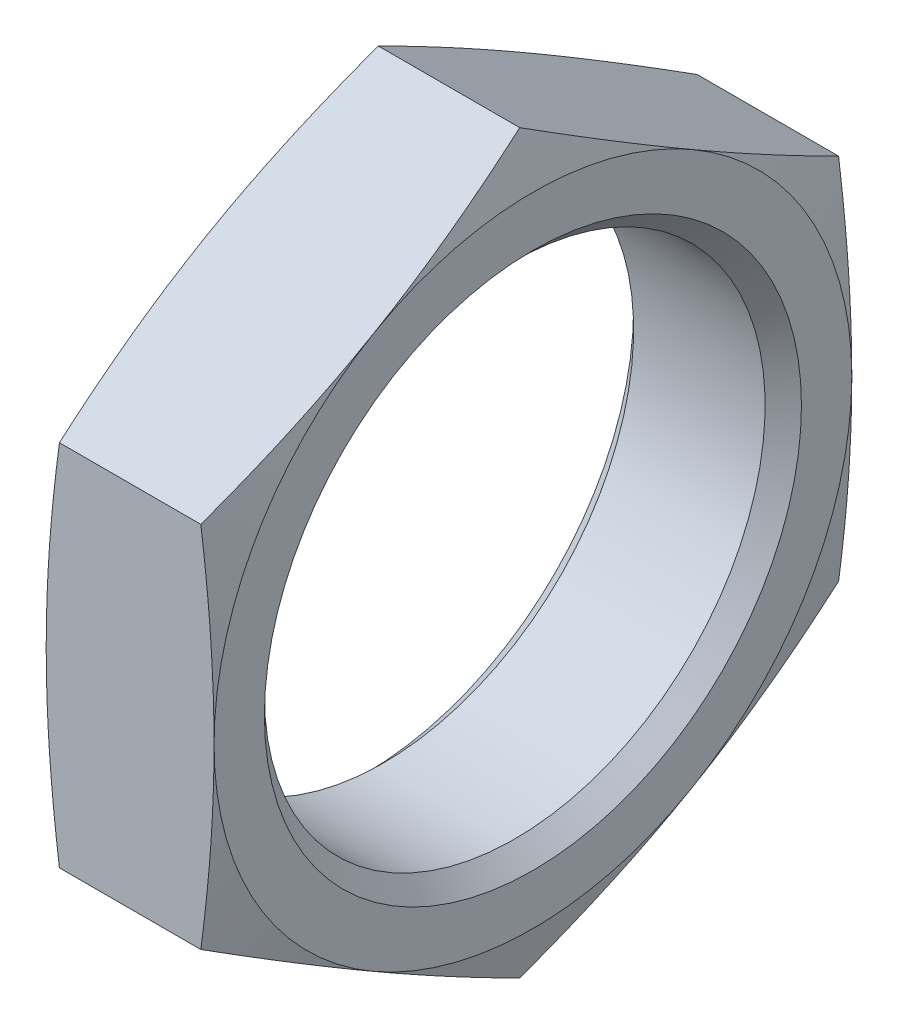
from build123d import *

# Parameters (mm, degrees)
SKIZZE3_W               = 38
SKIZZE3_H               = 38
LINEAR_AUSTRAGEN1_DEPTH = 5


with BuildPart() as part:
    # Skizze1 → Rotation1 (revolve)
    with BuildSketch(Plane.XY, mode=Mode.PRIVATE) as rotation1_sk:
        Polygon((0, 0), (0, 9.5), (1.018206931, 13.3), (3.981793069, 13.3), (5, 9.5), (5, 0), align=None)
    revolve(rotation1_sk.sketch.rotate(Axis((5, 0, 0), (-1, 0, 0)), 270), axis=Axis((5, 0, 0), (-1, 0, 0)))

    # Skizze2 → Schnitt-Rotation1 (revolve, cut)
    with BuildSketch(Plane.XY, mode=Mode.PRIVATE) as schnitt_rotation1_sk:
        Polygon((0, 0), (0, 8), (0.5415, 7.4585), (4.4585, 7.4585), (5, 8), (5, 0), align=None)
    revolve(schnitt_rotation1_sk.sketch.rotate(Axis((5, 0, 0), (-1, 0, 0)), 270), axis=Axis((5, 0, 0), (-1, 0, 0)), mode=Mode.SUBTRACT)

    # Skizze3 → Linear austragen1 (cut)
    with BuildSketch(Plane(origin=(0, 0, 0), x_dir=(0, 0, -1), z_dir=(1, 0, 0))):
        Rectangle(SKIZZE3_W, SKIZZE3_H)
        Polygon((-9.5, 5.484827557), (-9.5, -5.484827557), (0, -10.969655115), (9.5, -5.484827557), (9.5, 5.484827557), (0, 10.969655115), align=None, mode=Mode.SUBTRACT)
    extrude(amount=LINEAR_AUSTRAGEN1_DEPTH, mode=Mode.SUBTRACT)


solid = part.part
